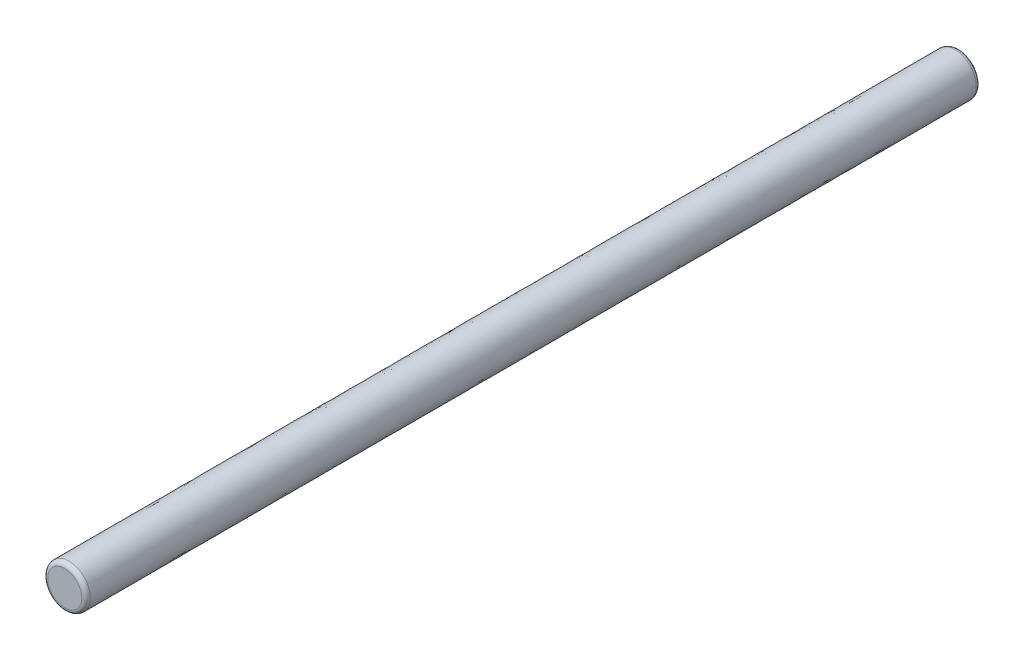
ISO-10303-21;
HEADER;
FILE_DESCRIPTION(('STEP AP214'),'2;1');
FILE_NAME('part.step','',(''),(''),'','','');
FILE_SCHEMA(('AUTOMOTIVE_DESIGN { 1 0 10303 214 1 1 1 1 }'));
ENDSEC;
DATA;
#1=APPLICATION_CONTEXT('core data for automotive mechanical design processes');
#2=APPLICATION_PROTOCOL_DEFINITION('international standard','automotive_design',2000,#1);
#3=PRODUCT_CONTEXT('',#1,'mechanical');
#4=PRODUCT('Part','Part','',(#3));
#5=PRODUCT_RELATED_PRODUCT_CATEGORY('part','',(#4));
#6=PRODUCT_DEFINITION_FORMATION('','',#4);
#7=PRODUCT_DEFINITION_CONTEXT('part definition',#1,'design');
#8=PRODUCT_DEFINITION('design','',#6,#7);
#9=PRODUCT_DEFINITION_SHAPE('','',#8);
#10=(LENGTH_UNIT() NAMED_UNIT(*) SI_UNIT(.MILLI.,.METRE.));
#11=(NAMED_UNIT(*) PLANE_ANGLE_UNIT() SI_UNIT($,.RADIAN.));
#12=(NAMED_UNIT(*) SI_UNIT($,.STERADIAN.) SOLID_ANGLE_UNIT());
#13=UNCERTAINTY_MEASURE_WITH_UNIT(LENGTH_MEASURE(1.E-05),#10,'distance_accuracy_value','');
#14=(GEOMETRIC_REPRESENTATION_CONTEXT(3) GLOBAL_UNCERTAINTY_ASSIGNED_CONTEXT((#13)) GLOBAL_UNIT_ASSIGNED_CONTEXT((#10,
#11,#12)) REPRESENTATION_CONTEXT('',''));
#15=CARTESIAN_POINT('',(0.,0.,0.));
#16=DIRECTION('',(0.,0.,1.));
#17=DIRECTION('',(1.,0.,0.));
#18=AXIS2_PLACEMENT_3D('',#15,#16,#17);
#19=CARTESIAN_POINT('',(0.,0.,-52.5));
#20=DIRECTION('',(0.,0.,1.));
#21=DIRECTION('',(1.,0.,0.));
#22=AXIS2_PLACEMENT_3D('',#19,#20,#21);
#23=PLANE('',#22);
#24=CARTESIAN_POINT('',(0.,0.,-52.5));
#25=DIRECTION('',(0.,0.,1.));
#26=DIRECTION('',(1.,0.,0.));
#27=AXIS2_PLACEMENT_3D('',#24,#25,#26);
#28=CIRCLE('',#27,2.);
#29=CARTESIAN_POINT('',(2.,0.,-52.5));
#30=VERTEX_POINT('',#29);
#31=EDGE_CURVE('E42',#30,#30,#28,.F.);
#32=ORIENTED_EDGE('',*,*,#31,.T.);
#33=EDGE_LOOP('',(#32));
#34=FACE_BOUND('',#33,.T.);
#35=ADVANCED_FACE('F26',(#34),#23,.F.);
#36=CARTESIAN_POINT('',(0.,0.,-52.));
#37=DIRECTION('',(0.,0.,1.));
#38=DIRECTION('',(1.,0.,0.));
#39=AXIS2_PLACEMENT_3D('',#36,#37,#38);
#40=TOROIDAL_SURFACE('',#39,2.,0.5);
#41=ORIENTED_EDGE('',*,*,#31,.F.);
#42=EDGE_LOOP('',(#41));
#43=FACE_BOUND('',#42,.T.);
#44=CARTESIAN_POINT('',(0.,0.,-52.));
#45=DIRECTION('',(0.,0.,1.));
#46=DIRECTION('',(1.,0.,0.));
#47=AXIS2_PLACEMENT_3D('',#44,#45,#46);
#48=CIRCLE('',#47,2.5);
#49=CARTESIAN_POINT('',(2.5,0.,-52.));
#50=VERTEX_POINT('',#49);
#51=EDGE_CURVE('E30',#50,#50,#48,.F.);
#52=ORIENTED_EDGE('',*,*,#51,.T.);
#53=EDGE_LOOP('',(#52));
#54=FACE_BOUND('',#53,.T.);
#55=ADVANCED_FACE('F63',(#43,#54),#40,.T.);
#56=CARTESIAN_POINT('',(-2.49999999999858,2.10859783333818E-13,51.9999999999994));
#57=CARTESIAN_POINT('',(-2.49999999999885,0.,47.8400000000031));
#58=CARTESIAN_POINT('',(-2.5000000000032,-4.76389685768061E-13,39.5200000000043));
#59=CARTESIAN_POINT('',(-2.49999999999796,1.5365107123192E-13,27.0399999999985));
#60=CARTESIAN_POINT('',(-2.5000000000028,1.46084203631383E-13,10.4000000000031));
#61=CARTESIAN_POINT('',(-2.49999999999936,-3.8393333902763E-13,-10.4000000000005));
#62=CARTESIAN_POINT('',(-2.50000000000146,0.,-27.0399999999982));
#63=CARTESIAN_POINT('',(-2.49999999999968,2.03402503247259E-13,-39.5200000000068));
#64=CARTESIAN_POINT('',(-2.49999999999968,1.48591674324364E-13,-47.8399999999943));
#65=CARTESIAN_POINT('',(-2.49999999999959,-1.07010888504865E-13,-51.9999999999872));
#66=CARTESIAN_POINT('',(-2.49999999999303,-0.476190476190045,51.9999999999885));
#67=CARTESIAN_POINT('',(-2.49999999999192,-0.476190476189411,47.8399999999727));
#68=CARTESIAN_POINT('',(-2.50000000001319,-0.476190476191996,39.5200000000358));
#69=CARTESIAN_POINT('',(-2.49999999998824,-0.476190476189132,27.0399999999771));
#70=CARTESIAN_POINT('',(-2.50000000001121,-0.476190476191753,10.4000000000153));
#71=CARTESIAN_POINT('',(-2.49999999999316,-0.476190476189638,-10.4000000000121));
#72=CARTESIAN_POINT('',(-2.50000000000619,-0.476190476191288,-27.0400000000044));
#73=CARTESIAN_POINT('',(-2.49999999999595,-0.476190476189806,-39.5199999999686));
#74=CARTESIAN_POINT('',(-2.50000000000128,-0.476190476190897,-47.8400000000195));
#75=CARTESIAN_POINT('',(-2.50000000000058,-0.476190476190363,-52.0000000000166));
#76=CARTESIAN_POINT('',(-2.22602739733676,-1.7808219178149,52.0000000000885));
#77=CARTESIAN_POINT('',(-2.22602739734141,-1.78082191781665,47.8400000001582));
#78=CARTESIAN_POINT('',(-2.22602739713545,-1.78082191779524,39.5199999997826));
#79=CARTESIAN_POINT('',(-2.22602739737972,-1.78082191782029,27.0400000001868));
#80=CARTESIAN_POINT('',(-2.22602739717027,-1.78082191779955,10.3999999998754));
#81=CARTESIAN_POINT('',(-2.22602739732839,-1.78082191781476,-10.3999999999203));
#82=CARTESIAN_POINT('',(-2.2260273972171,-1.78082191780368,-27.0400000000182));
#83=CARTESIAN_POINT('',(-2.22602739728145,-1.780821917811,-39.5200000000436));
#84=CARTESIAN_POINT('',(-2.2260273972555,-1.78082191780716,-47.8399999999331));
#85=CARTESIAN_POINT('',(-2.22602739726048,-1.78082191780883,-52.0000000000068));
#86=CARTESIAN_POINT('',(-0.707547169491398,-3.39622641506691,51.9999999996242));
#87=CARTESIAN_POINT('',(-0.707547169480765,-3.39622641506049,47.8399999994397));
#88=CARTESIAN_POINT('',(-0.707547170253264,-3.39622641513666,39.5200000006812));
#89=CARTESIAN_POINT('',(-0.707547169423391,-3.39622641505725,27.0399999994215));
#90=CARTESIAN_POINT('',(-0.707547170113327,-3.39622641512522,10.4000000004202));
#91=CARTESIAN_POINT('',(-0.707547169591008,-3.39622641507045,-10.4000000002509));
#92=CARTESIAN_POINT('',(-0.707547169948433,-3.39622641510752,-27.0399999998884));
#93=CARTESIAN_POINT('',(-0.707547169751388,-3.39622641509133,-39.5200000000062));
#94=CARTESIAN_POINT('',(-0.707547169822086,-3.39622641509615,-47.8400000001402));
#95=CARTESIAN_POINT('',(-0.707547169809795,-3.3962264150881,-51.9999999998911));
#96=CARTESIAN_POINT('',(1.50862068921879,-2.88793103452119,52.000000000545));
#97=CARTESIAN_POINT('',(1.50862068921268,-2.88793103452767,47.8400000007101));
#98=CARTESIAN_POINT('',(1.50862069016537,-2.88793103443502,39.5199999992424));
#99=CARTESIAN_POINT('',(1.50862068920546,-2.88793103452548,27.0400000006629));
#100=CARTESIAN_POINT('',(1.5086206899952,-2.88793103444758,10.3999999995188));
#101=CARTESIAN_POINT('',(1.50862068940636,-2.88793103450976,-10.3999999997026));
#102=CARTESIAN_POINT('',(1.50862068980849,-2.88793103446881,-27.04000000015));
#103=CARTESIAN_POINT('',(1.50862068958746,-2.88793103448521,-39.5199999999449));
#104=CARTESIAN_POINT('',(1.50862068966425,-2.88793103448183,-47.8399999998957));
#105=CARTESIAN_POINT('',(1.50862068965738,-2.88793103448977,-52.0000000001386));
#106=CARTESIAN_POINT('',(2.41477272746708,-1.05113636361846,51.9999999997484));
#107=CARTESIAN_POINT('',(2.41477272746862,-1.05113636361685,47.8399999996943));
#108=CARTESIAN_POINT('',(2.41477272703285,-1.0511363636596,39.5200000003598));
#109=CARTESIAN_POINT('',(2.41477272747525,-1.0511363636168,27.0399999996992));
#110=CARTESIAN_POINT('',(2.41477272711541,-1.05113636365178,10.4000000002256));
#111=CARTESIAN_POINT('',(2.41477272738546,-1.05113636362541,-10.400000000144));
#112=CARTESIAN_POINT('',(2.41477272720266,-1.0511363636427,-27.0399999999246));
#113=CARTESIAN_POINT('',(2.41477272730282,-1.05113636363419,-39.5200000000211));
#114=CARTESIAN_POINT('',(2.4147727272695,-1.05113636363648,-47.8400000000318));
#115=CARTESIAN_POINT('',(2.41477272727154,-1.05113636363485,-51.9999999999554));
#116=CARTESIAN_POINT('',(2.49999999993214,-0.217391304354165,52.0000000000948));
#117=CARTESIAN_POINT('',(2.4999999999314,-0.217391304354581,47.8400000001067));
#118=CARTESIAN_POINT('',(2.50000000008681,-0.217391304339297,39.5199999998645));
#119=CARTESIAN_POINT('',(2.499999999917,-0.217391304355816,27.0400000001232));
#120=CARTESIAN_POINT('',(2.50000000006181,-0.217391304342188,10.3999999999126));
#121=CARTESIAN_POINT('',(2.49999999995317,-0.21739130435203,-10.3999999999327));
#122=CARTESIAN_POINT('',(2.50000000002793,-0.217391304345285,-27.0400000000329));
#123=CARTESIAN_POINT('',(2.49999999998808,-0.217391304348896,-39.520000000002));
#124=CARTESIAN_POINT('',(2.5000000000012,-0.217391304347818,-47.8399999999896));
#125=CARTESIAN_POINT('',(2.49999999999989,-0.217391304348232,-51.999999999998));
#126=CARTESIAN_POINT('',(2.49999999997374,-2.50406925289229E-12,52.000000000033));
#127=CARTESIAN_POINT('',(2.49999999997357,-2.65656405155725E-12,47.840000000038));
#128=CARTESIAN_POINT('',(2.50000000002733,2.86301319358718E-12,39.5199999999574));
#129=CARTESIAN_POINT('',(2.4999999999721,-2.70687595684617E-12,27.0400000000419));
#130=CARTESIAN_POINT('',(2.50000000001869,1.45911662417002E-12,10.399999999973));
#131=CARTESIAN_POINT('',(2.49999999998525,-1.11700746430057E-12,-10.3999999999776));
#132=CARTESIAN_POINT('',(2.50000000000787,6.80764826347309E-13,-27.0400000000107));
#133=CARTESIAN_POINT('',(2.49999999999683,-2.99525834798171E-13,-39.5199999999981));
#134=CARTESIAN_POINT('',(2.49999999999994,-1.36166063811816E-13,-47.8400000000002));
#135=CARTESIAN_POINT('',(2.50000000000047,-1.40727044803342E-13,-52.0000000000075));
#136=CARTESIAN_POINT('',(2.50000000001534,0.217391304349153,51.9999999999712));
#137=CARTESIAN_POINT('',(2.50000000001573,0.217391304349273,47.8399999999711));
#138=CARTESIAN_POINT('',(2.49999999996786,0.217391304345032,39.5200000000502));
#139=CARTESIAN_POINT('',(2.50000000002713,0.217391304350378,27.0399999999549));
#140=CARTESIAN_POINT('',(2.49999999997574,0.217391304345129,10.4000000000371));
#141=CARTESIAN_POINT('',(2.50000000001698,0.217391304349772,-10.400000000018));
#142=CARTESIAN_POINT('',(2.4999999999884,0.217391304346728,-27.0399999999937));
#143=CARTESIAN_POINT('',(2.50000000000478,0.217391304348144,-39.5199999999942));
#144=CARTESIAN_POINT('',(2.49999999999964,0.217391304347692,-47.8400000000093));
#145=CARTESIAN_POINT('',(2.49999999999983,0.21739130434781,-52.0000000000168));
#146=CARTESIAN_POINT('',(2.4147727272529,1.05113636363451,52.000000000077));
#147=CARTESIAN_POINT('',(2.4147727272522,1.05113636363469,47.8400000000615));
#148=CARTESIAN_POINT('',(2.41477272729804,1.05113636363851,39.5199999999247));
#149=CARTESIAN_POINT('',(2.41477272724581,1.05113636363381,27.0400000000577));
#150=CARTESIAN_POINT('',(2.41477272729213,1.05113636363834,10.3999999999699));
#151=CARTESIAN_POINT('',(2.4147727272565,1.05113636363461,-10.3999999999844));
#152=CARTESIAN_POINT('',(2.41477272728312,1.05113636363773,-27.0399999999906));
#153=CARTESIAN_POINT('',(2.41477272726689,1.05113636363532,-39.5200000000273));
#154=CARTESIAN_POINT('',(2.41477272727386,1.05113636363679,-47.8399999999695));
#155=CARTESIAN_POINT('',(2.41477272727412,1.05113636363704,-51.9999999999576));
#156=CARTESIAN_POINT('',(1.50862068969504,2.88793103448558,51.9999999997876));
#157=CARTESIAN_POINT('',(1.50862068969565,2.88793103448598,47.8399999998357));
#158=CARTESIAN_POINT('',(1.50862068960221,2.88793103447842,39.5200000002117));
#159=CARTESIAN_POINT('',(1.5086206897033,2.88793103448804,27.0399999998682));
#160=CARTESIAN_POINT('',(1.50862068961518,2.88793103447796,10.4000000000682));
#161=CARTESIAN_POINT('',(1.50862068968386,2.8879310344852,-10.4000000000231));
#162=CARTESIAN_POINT('',(1.50862068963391,2.88793103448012,-27.0400000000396));
#163=CARTESIAN_POINT('',(1.50862068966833,2.88793103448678,-39.5199999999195));
#164=CARTESIAN_POINT('',(1.50862068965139,2.88793103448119,-47.8400000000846));
#165=CARTESIAN_POINT('',(1.50862068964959,2.88793103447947,-52.0000000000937));
#166=CARTESIAN_POINT('',(-0.70754716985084,3.39622641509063,52.000000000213));
#167=CARTESIAN_POINT('',(-0.707547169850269,3.39622641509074,47.8400000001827));
#168=CARTESIAN_POINT('',(-0.707547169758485,3.39622641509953,39.5199999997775));
#169=CARTESIAN_POINT('',(-0.707547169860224,3.39622641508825,27.0400000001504));
#170=CARTESIAN_POINT('',(-0.707547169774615,3.39622641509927,10.3999999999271));
#171=CARTESIAN_POINT('',(-0.707547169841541,3.39622641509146,-10.3999999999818));
#172=CARTESIAN_POINT('',(-0.707547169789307,3.39622641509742,-27.0399999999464));
#173=CARTESIAN_POINT('',(-0.707547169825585,3.39622641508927,-39.5200000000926));
#174=CARTESIAN_POINT('',(-0.707547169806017,3.39622641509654,-47.8399999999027));
#175=CARTESIAN_POINT('',(-0.707547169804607,3.39622641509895,-51.9999999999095));
#176=CARTESIAN_POINT('',(-2.22602739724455,1.78082191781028,51.9999999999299));
#177=CARTESIAN_POINT('',(-2.22602739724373,1.78082191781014,47.8399999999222));
#178=CARTESIAN_POINT('',(-2.22602739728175,1.78082191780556,39.5200000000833));
#179=CARTESIAN_POINT('',(-2.2260273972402,1.7808219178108,27.0399999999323));
#180=CARTESIAN_POINT('',(-2.22602739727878,1.78082191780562,10.4000000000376));
#181=CARTESIAN_POINT('',(-2.22602739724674,1.78082191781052,-10.400000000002));
#182=CARTESIAN_POINT('',(-2.22602739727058,1.7808219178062,-27.0400000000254));
#183=CARTESIAN_POINT('',(-2.22602739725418,1.78082191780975,-39.519999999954));
#184=CARTESIAN_POINT('',(-2.22602739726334,1.78082191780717,-47.8400000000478));
#185=CARTESIAN_POINT('',(-2.22602739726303,1.78082191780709,-52.0000000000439));
#186=CARTESIAN_POINT('',(-2.50000000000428,0.476190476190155,52.0000000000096));
#187=CARTESIAN_POINT('',(-2.50000000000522,0.476190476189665,47.8400000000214));
#188=CARTESIAN_POINT('',(-2.49999999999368,0.476190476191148,39.5199999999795));
#189=CARTESIAN_POINT('',(-2.50000000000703,0.476190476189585,27.0400000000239));
#190=CARTESIAN_POINT('',(-2.49999999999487,0.476190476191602,10.399999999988));
#191=CARTESIAN_POINT('',(-2.50000000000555,0.476190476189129,-10.4000000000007));
#192=CARTESIAN_POINT('',(-2.49999999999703,0.476190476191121,-27.0399999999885));
#193=CARTESIAN_POINT('',(-2.50000000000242,0.476190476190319,-39.5200000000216));
#194=CARTESIAN_POINT('',(-2.49999999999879,0.476190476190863,-47.8399999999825));
#195=CARTESIAN_POINT('',(-2.49999999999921,0.476190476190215,-51.9999999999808));
#196=CARTESIAN_POINT('',(-2.49999999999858,2.10859783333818E-13,51.9999999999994));
#197=CARTESIAN_POINT('',(-2.49999999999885,0.,47.8400000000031));
#198=CARTESIAN_POINT('',(-2.5000000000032,-4.76389685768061E-13,39.5200000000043));
#199=CARTESIAN_POINT('',(-2.49999999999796,1.5365107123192E-13,27.0399999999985));
#200=CARTESIAN_POINT('',(-2.5000000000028,1.46084203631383E-13,10.4000000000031));
#201=CARTESIAN_POINT('',(-2.49999999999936,-3.8393333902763E-13,-10.4000000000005));
#202=CARTESIAN_POINT('',(-2.50000000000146,0.,-27.0399999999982));
#203=CARTESIAN_POINT('',(-2.49999999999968,2.03402503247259E-13,-39.5200000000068));
#204=CARTESIAN_POINT('',(-2.49999999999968,1.48591674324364E-13,-47.8399999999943));
#205=CARTESIAN_POINT('',(-2.49999999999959,-1.07010888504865E-13,-51.9999999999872));
#206=(BOUNDED_SURFACE() B_SPLINE_SURFACE(5,5,((#56,#57,#58,#59,#60,#61,#62,#63,#64,#65),(#66,
#67,#68,#69,#70,#71,#72,#73,#74,#75),(#76,#77,#78,#79,#80,#81,#82,#83,#84,#85),(#86,#87,#88,#89,
#90,#91,#92,#93,#94,#95),(#96,#97,#98,#99,#100,#101,#102,#103,#104,#105),(#106,#107,#108,#109,
#110,#111,#112,#113,#114,#115),(#116,#117,#118,#119,#120,#121,#122,#123,#124,#125),(#126,#127,
#128,#129,#130,#131,#132,#133,#134,#135),(#136,#137,#138,#139,#140,#141,#142,#143,#144,#145),
(#146,#147,#148,#149,#150,#151,#152,#153,#154,#155),(#156,#157,#158,#159,#160,#161,#162,#163,
#164,#165),(#166,#167,#168,#169,#170,#171,#172,#173,#174,#175),(#176,#177,#178,#179,#180,#181,
#182,#183,#184,#185),(#186,#187,#188,#189,#190,#191,#192,#193,#194,#195),(#196,#197,#198,#199,
#200,#201,#202,#203,#204,#205)),.UNSPECIFIED.,.T.,.F.,.F.) B_SPLINE_SURFACE_WITH_KNOTS((6,1,1,5,
1,1,6),(6,1,1,1,1,6),(0.,0.6,1.2,1.5,1.8,2.4,3.),(0.,0.6,1.2,1.8,2.4,3.),
.UNSPECIFIED.) GEOMETRIC_REPRESENTATION_ITEM() RATIONAL_B_SPLINE_SURFACE(((0.999999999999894,
1.00000000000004,1.0000000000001,0.999999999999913,0.999999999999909,1.00000000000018,
1.00000000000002,0.999999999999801,0.999999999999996,1.00000000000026),(0.84000000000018,
0.839999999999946,0.83999999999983,0.840000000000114,0.840000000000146,0.839999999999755,
0.83999999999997,0.840000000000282,0.84000000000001,0.839999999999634),(0.5839999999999,
0.584000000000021,0.584000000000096,0.583999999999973,0.583999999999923,0.584000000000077,
0.58400000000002,0.583999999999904,0.583999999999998,0.584000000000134),(0.423999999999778,
0.424000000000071,0.42400000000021,0.423999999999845,0.423999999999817,0.424000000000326,
0.424000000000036,0.423999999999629,0.423999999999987,0.424000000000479),(0.464000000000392,
0.463999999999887,0.463999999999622,0.464000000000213,0.464000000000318,0.463999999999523,
0.463999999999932,0.464000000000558,0.464000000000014,0.463999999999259),(0.703999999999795,
0.704000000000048,0.704000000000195,0.703999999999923,0.70399999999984,0.704000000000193,
0.704000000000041,0.70399999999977,0.703999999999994,0.704000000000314),(0.919999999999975,
0.920000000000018,0.920000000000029,0.919999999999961,0.919999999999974,0.920000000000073,
0.919999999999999,0.919999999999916,0.919999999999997,0.920000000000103),(1.00000000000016,
0.999999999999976,0.999999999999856,1.00000000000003,1.00000000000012,0.999999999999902,
0.999999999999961,1.00000000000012,1.,0.999999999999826),(0.919999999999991,0.919999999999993,
0.920000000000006,0.920000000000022,0.919999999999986,0.919999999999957,0.920000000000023,
0.920000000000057,0.91999999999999,0.919999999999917),(0.70399999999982,0.704000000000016,
0.704000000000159,0.703999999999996,0.703999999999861,0.70400000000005,0.704000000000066,
0.703999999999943,0.703999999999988,0.704000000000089),(0.464000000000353,0.463999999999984,
0.46399999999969,0.46399999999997,0.46400000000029,0.463999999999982,0.46399999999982,
0.463999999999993,0.464000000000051,0.464000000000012),(0.423999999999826,0.424000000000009,
0.424000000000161,0.424000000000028,0.423999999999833,0.423999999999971,0.424000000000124,
0.424000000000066,0.423999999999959,0.423999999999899),(0.583999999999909,0.584000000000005,
0.584000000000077,0.584000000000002,0.583999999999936,0.584000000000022,0.58400000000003,
0.583999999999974,0.583999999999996,0.584000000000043),(0.840000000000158,0.839999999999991,
0.839999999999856,0.839999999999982,0.840000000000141,0.840000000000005,0.839999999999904,
0.839999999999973,0.84000000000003,0.840000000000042),(0.999999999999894,1.00000000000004,
1.0000000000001,0.999999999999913,0.999999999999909,1.00000000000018,1.00000000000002,
0.999999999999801,0.999999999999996,1.00000000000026))) REPRESENTATION_ITEM('') SURFACE());
#207=CARTESIAN_POINT('',(0.,0.,52.));
#208=DIRECTION('',(0.,0.,1.));
#209=DIRECTION('',(1.,0.,0.));
#210=AXIS2_PLACEMENT_3D('',#207,#208,#209);
#211=CIRCLE('',#210,2.5);
#212=CARTESIAN_POINT('',(2.5,-1.25203462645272E-12,52.));
#213=VERTEX_POINT('',#212);
#214=EDGE_CURVE('E36',#213,#213,#211,.F.);
#215=ORIENTED_EDGE('',*,*,#51,.F.);
#216=EDGE_LOOP('',(#215));
#217=FACE_BOUND('',#216,.T.);
#218=ORIENTED_EDGE('',*,*,#214,.T.);
#219=EDGE_LOOP('',(#218));
#220=FACE_BOUND('',#219,.T.);
#221=ADVANCED_FACE('F58',(#217,#220),#206,.F.);
#222=CARTESIAN_POINT('',(0.,0.,52.));
#223=DIRECTION('',(0.,0.,1.));
#224=DIRECTION('',(1.,0.,0.));
#225=AXIS2_PLACEMENT_3D('',#222,#223,#224);
#226=TOROIDAL_SURFACE('',#225,2.,0.5);
#227=ORIENTED_EDGE('',*,*,#214,.F.);
#228=EDGE_LOOP('',(#227));
#229=FACE_BOUND('',#228,.T.);
#230=CARTESIAN_POINT('',(0.,0.,52.5));
#231=DIRECTION('',(0.,0.,1.));
#232=DIRECTION('',(1.,0.,0.));
#233=AXIS2_PLACEMENT_3D('',#230,#231,#232);
#234=CIRCLE('',#233,2.);
#235=CARTESIAN_POINT('',(2.,0.,52.5));
#236=VERTEX_POINT('',#235);
#237=EDGE_CURVE('E11',#236,#236,#234,.T.);
#238=ORIENTED_EDGE('',*,*,#237,.F.);
#239=EDGE_LOOP('',(#238));
#240=FACE_BOUND('',#239,.T.);
#241=ADVANCED_FACE('F52',(#229,#240),#226,.T.);
#242=CARTESIAN_POINT('',(0.,0.,52.5));
#243=DIRECTION('',(0.,0.,1.));
#244=DIRECTION('',(1.,0.,0.));
#245=AXIS2_PLACEMENT_3D('',#242,#243,#244);
#246=PLANE('',#245);
#247=ORIENTED_EDGE('',*,*,#237,.T.);
#248=EDGE_LOOP('',(#247));
#249=FACE_BOUND('',#248,.T.);
#250=ADVANCED_FACE('F28',(#249),#246,.T.);
#251=CLOSED_SHELL('',(#35,#55,#221,#241,#250));
#252=MANIFOLD_SOLID_BREP('B2',#251);
#253=ADVANCED_BREP_SHAPE_REPRESENTATION('',(#18,#252),#14);
#254=SHAPE_DEFINITION_REPRESENTATION(#9,#253);
ENDSEC;
END-ISO-10303-21;
